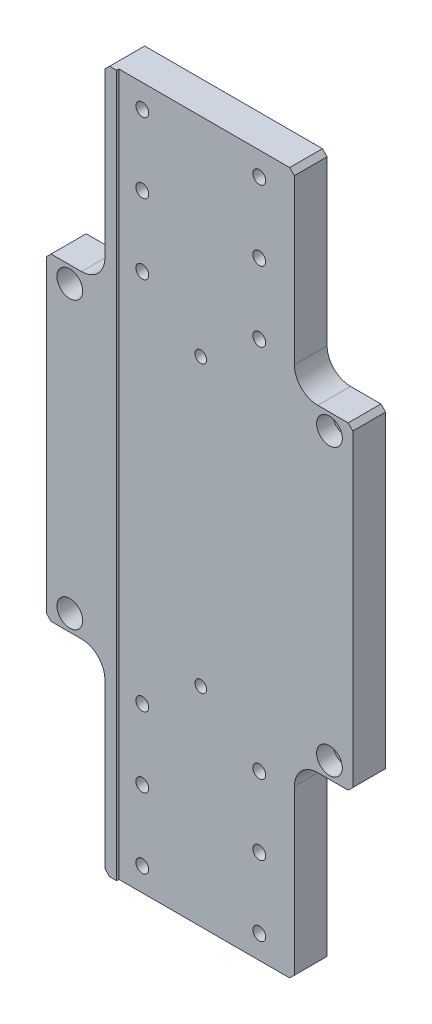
from build123d import *

# Parameters (mm, degrees)
SKETCH_1_W                   = 80
SKETCH_1_H                   = 82
SKETCH_1_W_2                 = 25
SKETCH_1_H_2                 = 136
EXTRUDE_1_DEPTH              = 7.5
SKETCH_2_W                   = 100
SKETCH_2_H                   = 300
CUT_EXTRUDE_1_DEPTH          = 1
F_5_0MM_1_D                  = 5
HOLE_WIZARD_M5_1_D           = 5.5
HOLE_WIZARD_M5_1_CBORE_D     = 9.5
HOLE_WIZARD_M5_1_CBORE_DEPTH = 7
PATTERN_LINEAR_1_COUNT       = 2
PATTERN_LINEAR_1_PITCH       = 220
HOLE_WIZARD_M6_1_D           = 6.6
HOLE_WIZARD_M6_1_CBORE_D     = 11
HOLE_WIZARD_M6_1_CBORE_DEPTH = 8
FILLET_1_R                   = 10
CHAMFER_1_SIZE               = 2


with BuildPart() as part:
    # Sketch 1 → Extrude 1 (new, symmetric)
    with BuildSketch(Plane.XY):
        with Locations((0, 109)):
            Rectangle(SKETCH_1_W, SKETCH_1_H)
        with Locations((-52.5, 0)):
            Rectangle(SKETCH_1_W_2, SKETCH_1_H_2)
        Rectangle(SKETCH_1_W, SKETCH_1_H_2)
        with Locations((52.5, 0)):
            Rectangle(SKETCH_1_W_2, SKETCH_1_H_2)
        with Locations((0, -109)):
            Rectangle(SKETCH_1_W, SKETCH_1_H)
    extrude(amount=EXTRUDE_1_DEPTH, both=True)

    # Sketch 2 → Cut-Extrude 1 (cut)
    with BuildSketch(Plane.XY.offset(7.5)):
        with Locations((15, 0)):
            Rectangle(SKETCH_2_W, SKETCH_2_H)
    extrude(amount=-CUT_EXTRUDE_1_DEPTH, mode=Mode.SUBTRACT)

    # 5.0mm _ _1 (through all)
    with Locations(Plane.XY.offset(6.5)):
        with Locations((0, -61), (0, 61)):
            Hole(F_5_0MM_1_D / 2)

    # Hole Wizard M5 _ _ _ _ _1 (through all)
    with Locations(Plane(origin=(0, 0, -7.5), x_dir=(-1, 0, 0), z_dir=(0, 0, -1))):
        with Locations((-25, 140), (25, 140), (-25, 110), (25, 110), (-25, 80), (25, 80)):
            hole_wizard_m5_1 = CounterBoreHole(HOLE_WIZARD_M5_1_D / 2, HOLE_WIZARD_M5_1_CBORE_D / 2, HOLE_WIZARD_M5_1_CBORE_DEPTH)

    # Pattern Linear 1: Hole Wizard M5 _ _ _ _ _1 ×2
    with Locations(*[(0, -i * PATTERN_LINEAR_1_PITCH, 0) for i in range(1, PATTERN_LINEAR_1_COUNT)]):
        add(hole_wizard_m5_1, mode=Mode.SUBTRACT)

    # Hole Wizard M6 _ _ _ _ _1 (through all)
    with Locations(Plane.XY.offset(7.5)):
        with Locations((-55, 61), (-55, -61), (55, 61), (55, -61)):
            CounterBoreHole(HOLE_WIZARD_M6_1_D / 2, HOLE_WIZARD_M6_1_CBORE_D / 2, HOLE_WIZARD_M6_1_CBORE_DEPTH)

    # Fillet 1
    fillet_1_edges = [part.edges().sort_by_distance(p)[0] for p in [
        (-40, -68, 0),
        (-40, 68, 0),
        (40, 68, -0.5),
        (40, -68, -0.5),
    ]]
    fillet(fillet_1_edges, radius=FILLET_1_R)

    # Chamfer 1
    chamfer_1_edges = [part.edges().sort_by_distance(p)[0] for p in [
        (-40, -150, 0),
        (-65, -68, 0),
        (-65, 68, 0),
        (-40, 150, 0),
        (65, 68, -0.5),
        (65, -68, -0.5),
        (40, -150, -0.5),
        (40, 150, -0.5),
    ]]
    chamfer(chamfer_1_edges, length=CHAMFER_1_SIZE)


solid = part.part
